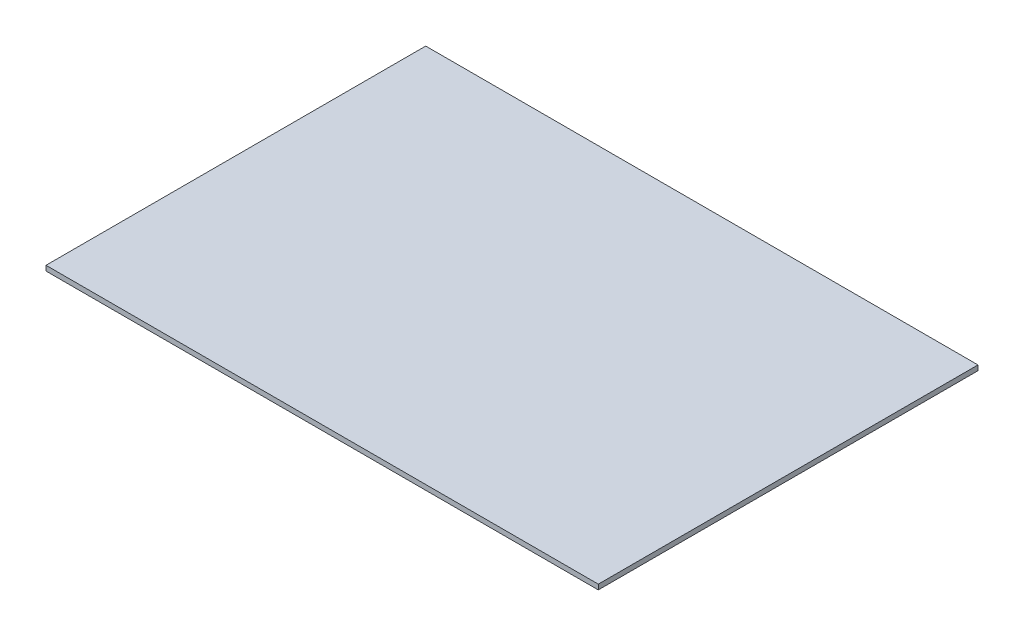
ISO-10303-21;
HEADER;
FILE_DESCRIPTION(('STEP AP214'),'2;1');
FILE_NAME('part.step','',(''),(''),'','','');
FILE_SCHEMA(('AUTOMOTIVE_DESIGN { 1 0 10303 214 1 1 1 1 }'));
ENDSEC;
DATA;
#1=APPLICATION_CONTEXT('core data for automotive mechanical design processes');
#2=APPLICATION_PROTOCOL_DEFINITION('international standard','automotive_design',2000,#1);
#3=PRODUCT_CONTEXT('',#1,'mechanical');
#4=PRODUCT('Part','Part','',(#3));
#5=PRODUCT_RELATED_PRODUCT_CATEGORY('part','',(#4));
#6=PRODUCT_DEFINITION_FORMATION('','',#4);
#7=PRODUCT_DEFINITION_CONTEXT('part definition',#1,'design');
#8=PRODUCT_DEFINITION('design','',#6,#7);
#9=PRODUCT_DEFINITION_SHAPE('','',#8);
#10=(LENGTH_UNIT() NAMED_UNIT(*) SI_UNIT(.MILLI.,.METRE.));
#11=(NAMED_UNIT(*) PLANE_ANGLE_UNIT() SI_UNIT($,.RADIAN.));
#12=(NAMED_UNIT(*) SI_UNIT($,.STERADIAN.) SOLID_ANGLE_UNIT());
#13=UNCERTAINTY_MEASURE_WITH_UNIT(LENGTH_MEASURE(1.E-05),#10,'distance_accuracy_value','');
#14=(GEOMETRIC_REPRESENTATION_CONTEXT(3) GLOBAL_UNCERTAINTY_ASSIGNED_CONTEXT((#13)) GLOBAL_UNIT_ASSIGNED_CONTEXT((#10,
#11,#12)) REPRESENTATION_CONTEXT('',''));
#15=CARTESIAN_POINT('',(0.,0.,0.));
#16=DIRECTION('',(0.,0.,1.));
#17=DIRECTION('',(1.,0.,0.));
#18=AXIS2_PLACEMENT_3D('',#15,#16,#17);
#19=CARTESIAN_POINT('',(304.8,5.55625,209.55));
#20=DIRECTION('',(-1.,0.,0.));
#21=DIRECTION('',(0.,0.,1.));
#22=AXIS2_PLACEMENT_3D('',#19,#20,#21);
#23=PLANE('',#22);
#24=DIRECTION('',(0.,0.,-1.));
#25=VECTOR('',#24,1.);
#26=CARTESIAN_POINT('',(304.8,0.,209.55));
#27=LINE('',#26,#25);
#28=CARTESIAN_POINT('',(304.8,0.,209.55));
#29=VERTEX_POINT('',#28);
#30=CARTESIAN_POINT('',(304.8,0.,-209.55));
#31=VERTEX_POINT('',#30);
#32=EDGE_CURVE('E95',#29,#31,#27,.T.);
#33=ORIENTED_EDGE('',*,*,#32,.T.);
#34=DIRECTION('',(0.,-1.,0.));
#35=VECTOR('',#34,1.);
#36=CARTESIAN_POINT('',(304.8,5.55625,-209.55));
#37=LINE('',#36,#35);
#38=CARTESIAN_POINT('',(304.8,5.55625,-209.55));
#39=VERTEX_POINT('',#38);
#40=EDGE_CURVE('E11',#39,#31,#37,.T.);
#41=ORIENTED_EDGE('',*,*,#40,.F.);
#42=DIRECTION('',(0.,0.,-1.));
#43=VECTOR('',#42,1.);
#44=CARTESIAN_POINT('',(304.8,5.55625,209.55));
#45=LINE('',#44,#43);
#46=CARTESIAN_POINT('',(304.8,5.55625,209.55));
#47=VERTEX_POINT('',#46);
#48=EDGE_CURVE('E83',#47,#39,#45,.T.);
#49=ORIENTED_EDGE('',*,*,#48,.F.);
#50=DIRECTION('',(0.,-1.,0.));
#51=VECTOR('',#50,1.);
#52=CARTESIAN_POINT('',(304.8,5.55625,209.55));
#53=LINE('',#52,#51);
#54=EDGE_CURVE('E91',#47,#29,#53,.T.);
#55=ORIENTED_EDGE('',*,*,#54,.T.);
#56=EDGE_LOOP('',(#33,#41,#49,#55));
#57=FACE_BOUND('',#56,.T.);
#58=ADVANCED_FACE('F32',(#57),#23,.F.);
#59=CARTESIAN_POINT('',(-304.8,5.55625,-209.55));
#60=DIRECTION('',(0.,0.,1.));
#61=DIRECTION('',(1.,0.,0.));
#62=AXIS2_PLACEMENT_3D('',#59,#60,#61);
#63=PLANE('',#62);
#64=DIRECTION('',(-1.,0.,0.));
#65=VECTOR('',#64,1.);
#66=CARTESIAN_POINT('',(-304.8,0.,-209.55));
#67=LINE('',#66,#65);
#68=CARTESIAN_POINT('',(-304.8,0.,-209.55));
#69=VERTEX_POINT('',#68);
#70=EDGE_CURVE('E87',#31,#69,#67,.T.);
#71=ORIENTED_EDGE('',*,*,#70,.T.);
#72=DIRECTION('',(0.,-1.,0.));
#73=VECTOR('',#72,1.);
#74=CARTESIAN_POINT('',(-304.8,5.55625,-209.55));
#75=LINE('',#74,#73);
#76=CARTESIAN_POINT('',(-304.8,5.55625,-209.55));
#77=VERTEX_POINT('',#76);
#78=EDGE_CURVE('E40',#77,#69,#75,.T.);
#79=ORIENTED_EDGE('',*,*,#78,.F.);
#80=DIRECTION('',(-1.,0.,0.));
#81=VECTOR('',#80,1.);
#82=CARTESIAN_POINT('',(-304.8,5.55625,-209.55));
#83=LINE('',#82,#81);
#84=EDGE_CURVE('E78',#39,#77,#83,.T.);
#85=ORIENTED_EDGE('',*,*,#84,.F.);
#86=ORIENTED_EDGE('',*,*,#40,.T.);
#87=EDGE_LOOP('',(#71,#79,#85,#86));
#88=FACE_BOUND('',#87,.T.);
#89=ADVANCED_FACE('F86',(#88),#63,.F.);
#90=CARTESIAN_POINT('',(-304.8,5.55625,209.55));
#91=DIRECTION('',(1.,0.,0.));
#92=DIRECTION('',(0.,0.,-1.));
#93=AXIS2_PLACEMENT_3D('',#90,#91,#92);
#94=PLANE('',#93);
#95=DIRECTION('',(0.,0.,1.));
#96=VECTOR('',#95,1.);
#97=CARTESIAN_POINT('',(-304.8,0.,209.55));
#98=LINE('',#97,#96);
#99=CARTESIAN_POINT('',(-304.8,0.,209.55));
#100=VERTEX_POINT('',#99);
#101=EDGE_CURVE('E65',#69,#100,#98,.T.);
#102=ORIENTED_EDGE('',*,*,#101,.T.);
#103=DIRECTION('',(0.,-1.,0.));
#104=VECTOR('',#103,1.);
#105=CARTESIAN_POINT('',(-304.8,5.55625,209.55));
#106=LINE('',#105,#104);
#107=CARTESIAN_POINT('',(-304.8,5.55625,209.55));
#108=VERTEX_POINT('',#107);
#109=EDGE_CURVE('E88',#108,#100,#106,.T.);
#110=ORIENTED_EDGE('',*,*,#109,.F.);
#111=DIRECTION('',(0.,0.,1.));
#112=VECTOR('',#111,1.);
#113=CARTESIAN_POINT('',(-304.8,5.55625,209.55));
#114=LINE('',#113,#112);
#115=EDGE_CURVE('E81',#77,#108,#114,.T.);
#116=ORIENTED_EDGE('',*,*,#115,.F.);
#117=ORIENTED_EDGE('',*,*,#78,.T.);
#118=EDGE_LOOP('',(#102,#110,#116,#117));
#119=FACE_BOUND('',#118,.T.);
#120=ADVANCED_FACE('F89',(#119),#94,.F.);
#121=CARTESIAN_POINT('',(-304.8,5.55625,209.55));
#122=DIRECTION('',(0.,0.,-1.));
#123=DIRECTION('',(-1.,0.,0.));
#124=AXIS2_PLACEMENT_3D('',#121,#122,#123);
#125=PLANE('',#124);
#126=DIRECTION('',(1.,0.,0.));
#127=VECTOR('',#126,1.);
#128=CARTESIAN_POINT('',(-304.8,0.,209.55));
#129=LINE('',#128,#127);
#130=EDGE_CURVE('E71',#100,#29,#129,.T.);
#131=ORIENTED_EDGE('',*,*,#130,.T.);
#132=ORIENTED_EDGE('',*,*,#54,.F.);
#133=DIRECTION('',(1.,0.,0.));
#134=VECTOR('',#133,1.);
#135=CARTESIAN_POINT('',(-304.8,5.55625,209.55));
#136=LINE('',#135,#134);
#137=EDGE_CURVE('E48',#108,#47,#136,.T.);
#138=ORIENTED_EDGE('',*,*,#137,.F.);
#139=ORIENTED_EDGE('',*,*,#109,.T.);
#140=EDGE_LOOP('',(#131,#132,#138,#139));
#141=FACE_BOUND('',#140,.T.);
#142=ADVANCED_FACE('F102',(#141),#125,.F.);
#143=CARTESIAN_POINT('',(0.,5.55625,0.));
#144=DIRECTION('',(0.,-1.,0.));
#145=DIRECTION('',(0.,0.,-1.));
#146=AXIS2_PLACEMENT_3D('',#143,#144,#145);
#147=PLANE('',#146);
#148=ORIENTED_EDGE('',*,*,#48,.T.);
#149=ORIENTED_EDGE('',*,*,#84,.T.);
#150=ORIENTED_EDGE('',*,*,#115,.T.);
#151=ORIENTED_EDGE('',*,*,#137,.T.);
#152=EDGE_LOOP('',(#148,#149,#150,#151));
#153=FACE_BOUND('',#152,.T.);
#154=ADVANCED_FACE('F79',(#153),#147,.F.);
#155=CARTESIAN_POINT('',(0.,0.,0.));
#156=DIRECTION('',(0.,-1.,0.));
#157=DIRECTION('',(0.,0.,-1.));
#158=AXIS2_PLACEMENT_3D('',#155,#156,#157);
#159=PLANE('',#158);
#160=ORIENTED_EDGE('',*,*,#32,.F.);
#161=ORIENTED_EDGE('',*,*,#130,.F.);
#162=ORIENTED_EDGE('',*,*,#101,.F.);
#163=ORIENTED_EDGE('',*,*,#70,.F.);
#164=EDGE_LOOP('',(#160,#161,#162,#163));
#165=FACE_BOUND('',#164,.T.);
#166=ADVANCED_FACE('F105',(#165),#159,.T.);
#167=CLOSED_SHELL('',(#58,#89,#120,#142,#154,#166));
#168=MANIFOLD_SOLID_BREP('B2',#167);
#169=ADVANCED_BREP_SHAPE_REPRESENTATION('',(#18,#168),#14);
#170=SHAPE_DEFINITION_REPRESENTATION(#9,#169);
ENDSEC;
END-ISO-10303-21;
